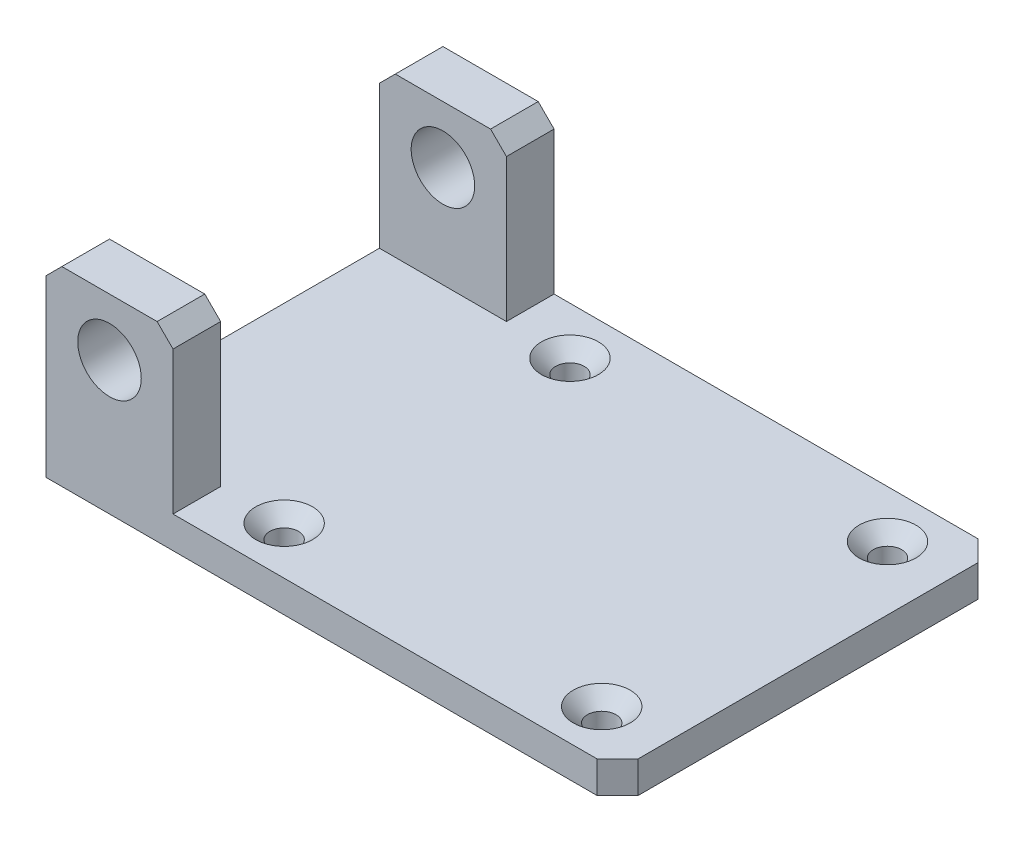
from build123d import *

# Parameters (mm, degrees)
SKETCH2_W                                            = 180
SKETCH2_H                                            = 120
BOSS_EXTRUDE1_DEPTH                                  = 10
SKETCH4_W                                            = 40
SKETCH4_H                                            = 50
SKETCH4_R                                            = 10
BOSS_EXTRUDE2_DEPTH                                  = 15
CHAMFER1_SIZE                                        = 5
CHAMFER1_OF_MIRROR1_SIZE                             = 5
CHAMFER3_SIZE                                        = 6.5
CSK_FOR_M8_HEX_SOCKET_COUNTERSUNK_CAP_SC_D           = 9
CSK_FOR_M8_HEX_SOCKET_COUNTERSUNK_CAP_SC_CSINK_D     = 17.92
CSK_FOR_M8_HEX_SOCKET_COUNTERSUNK_CAP_SC_CSINK_ANGLE = 90


with BuildPart() as part:
    # Sketch2 → Boss-Extrude1 (new body)
    with BuildSketch(Plane(origin=(0, 0, 0), x_dir=(1, 0, 0), z_dir=(0, 1, 0))):
        Rectangle(SKETCH2_W, SKETCH2_H)
    extrude(amount=BOSS_EXTRUDE1_DEPTH)

    # Sketch4 → Boss-Extrude2 (add)
    with BuildSketch(Plane.XY.offset(60)):
        with Locations((-70, 35)):
            Rectangle(SKETCH4_W, SKETCH4_H)
        with Locations((-70, 42)):
            Circle(SKETCH4_R, mode=Mode.SUBTRACT)
    boss_extrude2 = extrude(amount=-BOSS_EXTRUDE2_DEPTH)

    # Chamfer1
    chamfer1_edges = [part.edges().sort_by_distance(p)[0] for p in [
        (-90, 60, 52.5),
        (-50, 60, 52.5),
    ]]
    chamfer(chamfer1_edges, length=CHAMFER1_SIZE)

    # Mirror1: Boss-Extrude2 across plane
    add(boss_extrude2.mirror(Plane.XY))

    # Chamfer1 of Mirror1
    chamfer1_of_mirror1_edges = [part.edges().sort_by_distance(p)[0] for p in [
        (-90, 60, -52.5),
        (-50, 60, -52.5),
    ]]
    chamfer(chamfer1_of_mirror1_edges, length=CHAMFER1_OF_MIRROR1_SIZE)

    # Chamfer3
    chamfer3_edges = [part.edges().sort_by_distance(p)[0] for p in [
        (90, 5, -60),
        (90, 5, 60),
    ]]
    chamfer(chamfer3_edges, length=CHAMFER3_SIZE)

    # CSK for M8 Hex Socket Countersunk Cap Sc (through all)
    with Locations(Plane(origin=(0, 10, 0), x_dir=(1, 0, 0), z_dir=(0, 1, 0))):
        with Locations((-30, -45), (70, -45), (-30, 45), (70, 45)):
            CounterSinkHole(CSK_FOR_M8_HEX_SOCKET_COUNTERSUNK_CAP_SC_D / 2, CSK_FOR_M8_HEX_SOCKET_COUNTERSUNK_CAP_SC_CSINK_D / 2, counter_sink_angle=CSK_FOR_M8_HEX_SOCKET_COUNTERSUNK_CAP_SC_CSINK_ANGLE)


solid = part.part
